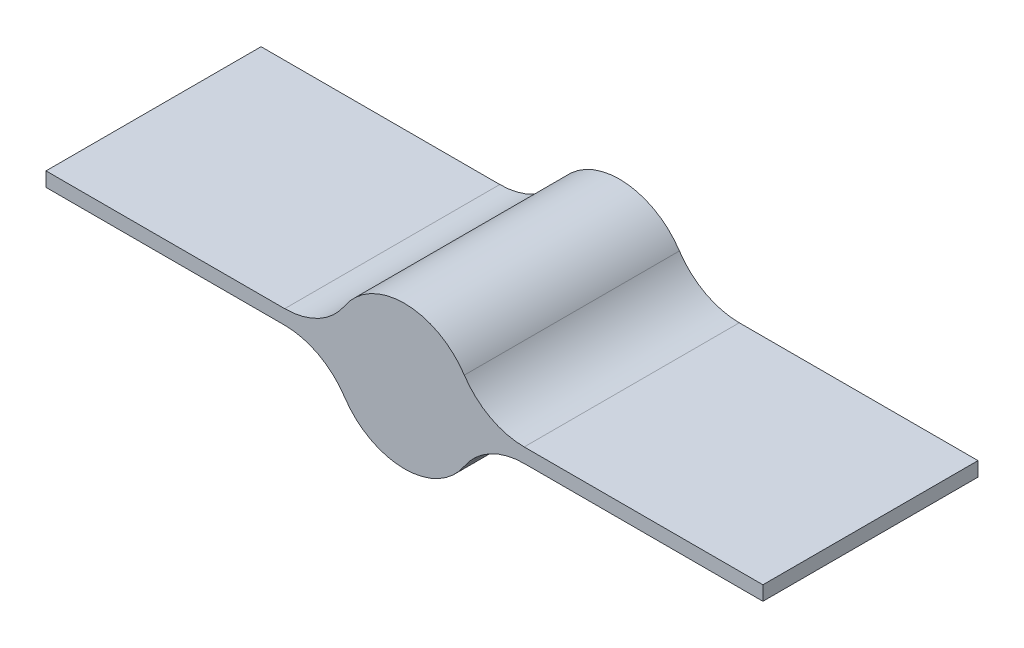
ISO-10303-21;
HEADER;
FILE_DESCRIPTION(('STEP AP214'),'2;1');
FILE_NAME('part.step','',(''),(''),'','','');
FILE_SCHEMA(('AUTOMOTIVE_DESIGN { 1 0 10303 214 1 1 1 1 }'));
ENDSEC;
DATA;
#1=APPLICATION_CONTEXT('core data for automotive mechanical design processes');
#2=APPLICATION_PROTOCOL_DEFINITION('international standard','automotive_design',2000,#1);
#3=PRODUCT_CONTEXT('',#1,'mechanical');
#4=PRODUCT('Part','Part','',(#3));
#5=PRODUCT_RELATED_PRODUCT_CATEGORY('part','',(#4));
#6=PRODUCT_DEFINITION_FORMATION('','',#4);
#7=PRODUCT_DEFINITION_CONTEXT('part definition',#1,'design');
#8=PRODUCT_DEFINITION('design','',#6,#7);
#9=PRODUCT_DEFINITION_SHAPE('','',#8);
#10=(LENGTH_UNIT() NAMED_UNIT(*) SI_UNIT(.MILLI.,.METRE.));
#11=(NAMED_UNIT(*) PLANE_ANGLE_UNIT() SI_UNIT($,.RADIAN.));
#12=(NAMED_UNIT(*) SI_UNIT($,.STERADIAN.) SOLID_ANGLE_UNIT());
#13=UNCERTAINTY_MEASURE_WITH_UNIT(LENGTH_MEASURE(1.E-05),#10,'distance_accuracy_value','');
#14=(GEOMETRIC_REPRESENTATION_CONTEXT(3) GLOBAL_UNCERTAINTY_ASSIGNED_CONTEXT((#13)) GLOBAL_UNIT_ASSIGNED_CONTEXT((#10,
#11,#12)) REPRESENTATION_CONTEXT('',''));
#15=CARTESIAN_POINT('',(0.,0.,0.));
#16=DIRECTION('',(0.,0.,1.));
#17=DIRECTION('',(1.,0.,0.));
#18=AXIS2_PLACEMENT_3D('',#15,#16,#17);
#19=CARTESIAN_POINT('',(0.,0.,30.));
#20=DIRECTION('',(0.,1.,0.));
#21=DIRECTION('',(0.,0.,1.));
#22=AXIS2_PLACEMENT_3D('',#19,#20,#21);
#23=PLANE('',#22);
#24=DIRECTION('',(1.,0.,0.));
#25=VECTOR('',#24,1.);
#26=CARTESIAN_POINT('',(0.,0.,0.));
#27=LINE('',#26,#25);
#28=CARTESIAN_POINT('',(0.,0.,0.));
#29=VERTEX_POINT('',#28);
#30=CARTESIAN_POINT('',(33.2967069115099,0.,0.));
#31=VERTEX_POINT('',#30);
#32=EDGE_CURVE('E120',#29,#31,#27,.T.);
#33=ORIENTED_EDGE('',*,*,#32,.T.);
#34=DIRECTION('',(0.,0.,1.));
#35=VECTOR('',#34,1.);
#36=CARTESIAN_POINT('',(33.2967069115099,0.,30.));
#37=LINE('',#36,#35);
#38=CARTESIAN_POINT('',(33.2967069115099,0.,30.));
#39=VERTEX_POINT('',#38);
#40=EDGE_CURVE('E182',#31,#39,#37,.T.);
#41=ORIENTED_EDGE('',*,*,#40,.T.);
#42=DIRECTION('',(1.,0.,0.));
#43=VECTOR('',#42,1.);
#44=CARTESIAN_POINT('',(0.,0.,30.));
#45=LINE('',#44,#43);
#46=CARTESIAN_POINT('',(0.,0.,30.));
#47=VERTEX_POINT('',#46);
#48=EDGE_CURVE('E138',#47,#39,#45,.T.);
#49=ORIENTED_EDGE('',*,*,#48,.F.);
#50=DIRECTION('',(0.,0.,-1.));
#51=VECTOR('',#50,1.);
#52=CARTESIAN_POINT('',(0.,0.,30.));
#53=LINE('',#52,#51);
#54=EDGE_CURVE('E136',#47,#29,#53,.T.);
#55=ORIENTED_EDGE('',*,*,#54,.T.);
#56=EDGE_LOOP('',(#33,#41,#49,#55));
#57=FACE_BOUND('',#56,.T.);
#58=ADVANCED_FACE('F32',(#57),#23,.F.);
#59=CARTESIAN_POINT('',(0.,2.,30.));
#60=DIRECTION('',(0.,-1.,0.));
#61=DIRECTION('',(0.,0.,-1.));
#62=AXIS2_PLACEMENT_3D('',#59,#60,#61);
#63=PLANE('',#62);
#64=DIRECTION('',(-1.,0.,0.));
#65=VECTOR('',#64,1.);
#66=CARTESIAN_POINT('',(0.,2.,0.));
#67=LINE('',#66,#65);
#68=CARTESIAN_POINT('',(100.,2.,0.));
#69=VERTEX_POINT('',#68);
#70=CARTESIAN_POINT('',(66.7032930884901,2.,0.));
#71=VERTEX_POINT('',#70);
#72=EDGE_CURVE('E157',#69,#71,#67,.T.);
#73=ORIENTED_EDGE('',*,*,#72,.T.);
#74=DIRECTION('',(0.,0.,1.));
#75=VECTOR('',#74,1.);
#76=CARTESIAN_POINT('',(66.7032930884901,2.,30.));
#77=LINE('',#76,#75);
#78=CARTESIAN_POINT('',(66.7032930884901,2.,30.));
#79=VERTEX_POINT('',#78);
#80=EDGE_CURVE('E188',#71,#79,#77,.T.);
#81=ORIENTED_EDGE('',*,*,#80,.T.);
#82=DIRECTION('',(-1.,0.,0.));
#83=VECTOR('',#82,1.);
#84=CARTESIAN_POINT('',(0.,2.,30.));
#85=LINE('',#84,#83);
#86=CARTESIAN_POINT('',(100.,2.,30.));
#87=VERTEX_POINT('',#86);
#88=EDGE_CURVE('E167',#87,#79,#85,.T.);
#89=ORIENTED_EDGE('',*,*,#88,.F.);
#90=DIRECTION('',(0.,0.,-1.));
#91=VECTOR('',#90,1.);
#92=CARTESIAN_POINT('',(100.,2.,30.));
#93=LINE('',#92,#91);
#94=EDGE_CURVE('E171',#87,#69,#93,.T.);
#95=ORIENTED_EDGE('',*,*,#94,.T.);
#96=EDGE_LOOP('',(#73,#81,#89,#95));
#97=FACE_BOUND('',#96,.T.);
#98=ADVANCED_FACE('F221',(#97),#63,.F.);
#99=CARTESIAN_POINT('',(0.,0.,30.));
#100=DIRECTION('',(1.,0.,0.));
#101=DIRECTION('',(0.,0.,-1.));
#102=AXIS2_PLACEMENT_3D('',#99,#100,#101);
#103=PLANE('',#102);
#104=DIRECTION('',(0.,-1.,0.));
#105=VECTOR('',#104,1.);
#106=CARTESIAN_POINT('',(0.,0.,0.));
#107=LINE('',#106,#105);
#108=CARTESIAN_POINT('',(0.,2.,0.));
#109=VERTEX_POINT('',#108);
#110=EDGE_CURVE('E125',#109,#29,#107,.T.);
#111=ORIENTED_EDGE('',*,*,#110,.T.);
#112=ORIENTED_EDGE('',*,*,#54,.F.);
#113=DIRECTION('',(0.,-1.,0.));
#114=VECTOR('',#113,1.);
#115=CARTESIAN_POINT('',(0.,0.,30.));
#116=LINE('',#115,#114);
#117=CARTESIAN_POINT('',(0.,2.,30.));
#118=VERTEX_POINT('',#117);
#119=EDGE_CURVE('E160',#118,#47,#116,.T.);
#120=ORIENTED_EDGE('',*,*,#119,.F.);
#121=DIRECTION('',(0.,0.,-1.));
#122=VECTOR('',#121,1.);
#123=CARTESIAN_POINT('',(0.,2.,30.));
#124=LINE('',#123,#122);
#125=EDGE_CURVE('E147',#118,#109,#124,.T.);
#126=ORIENTED_EDGE('',*,*,#125,.T.);
#127=EDGE_LOOP('',(#111,#112,#120,#126));
#128=FACE_BOUND('',#127,.T.);
#129=ADVANCED_FACE('F34',(#128),#103,.F.);
#130=CARTESIAN_POINT('',(66.7032930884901,0.,30.));
#131=VERTEX_POINT('',#130);
#132=CARTESIAN_POINT('',(100.,0.,30.));
#133=VERTEX_POINT('',#132);
#134=EDGE_CURVE('E162',#131,#133,#45,.T.);
#135=ORIENTED_EDGE('',*,*,#134,.F.);
#136=DIRECTION('',(0.,0.,1.));
#137=VECTOR('',#136,1.);
#138=CARTESIAN_POINT('',(66.7032930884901,0.,30.));
#139=LINE('',#138,#137);
#140=CARTESIAN_POINT('',(66.7032930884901,0.,0.));
#141=VERTEX_POINT('',#140);
#142=EDGE_CURVE('E191',#131,#141,#139,.F.);
#143=ORIENTED_EDGE('',*,*,#142,.T.);
#144=CARTESIAN_POINT('',(100.,0.,0.));
#145=VERTEX_POINT('',#144);
#146=EDGE_CURVE('E133',#141,#145,#27,.T.);
#147=ORIENTED_EDGE('',*,*,#146,.T.);
#148=DIRECTION('',(0.,0.,-1.));
#149=VECTOR('',#148,1.);
#150=CARTESIAN_POINT('',(100.,0.,30.));
#151=LINE('',#150,#149);
#152=EDGE_CURVE('E143',#133,#145,#151,.T.);
#153=ORIENTED_EDGE('',*,*,#152,.F.);
#154=EDGE_LOOP('',(#135,#143,#147,#153));
#155=FACE_BOUND('',#154,.T.);
#156=ADVANCED_FACE('F211',(#155),#23,.F.);
#157=CARTESIAN_POINT('',(100.,0.,30.));
#158=DIRECTION('',(-1.,0.,0.));
#159=DIRECTION('',(0.,0.,1.));
#160=AXIS2_PLACEMENT_3D('',#157,#158,#159);
#161=PLANE('',#160);
#162=DIRECTION('',(0.,1.,0.));
#163=VECTOR('',#162,1.);
#164=CARTESIAN_POINT('',(100.,0.,0.));
#165=LINE('',#164,#163);
#166=EDGE_CURVE('E132',#145,#69,#165,.T.);
#167=ORIENTED_EDGE('',*,*,#166,.T.);
#168=ORIENTED_EDGE('',*,*,#94,.F.);
#169=DIRECTION('',(0.,1.,0.));
#170=VECTOR('',#169,1.);
#171=CARTESIAN_POINT('',(100.,0.,30.));
#172=LINE('',#171,#170);
#173=EDGE_CURVE('E164',#133,#87,#172,.T.);
#174=ORIENTED_EDGE('',*,*,#173,.F.);
#175=ORIENTED_EDGE('',*,*,#152,.T.);
#176=EDGE_LOOP('',(#167,#168,#174,#175));
#177=FACE_BOUND('',#176,.T.);
#178=ADVANCED_FACE('F218',(#177),#161,.F.);
#179=CARTESIAN_POINT('',(33.2967069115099,2.,30.));
#180=VERTEX_POINT('',#179);
#181=EDGE_CURVE('E166',#180,#118,#85,.T.);
#182=ORIENTED_EDGE('',*,*,#181,.F.);
#183=DIRECTION('',(0.,0.,1.));
#184=VECTOR('',#183,1.);
#185=CARTESIAN_POINT('',(33.2967069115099,2.,30.));
#186=LINE('',#185,#184);
#187=CARTESIAN_POINT('',(33.2967069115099,2.,0.));
#188=VERTEX_POINT('',#187);
#189=EDGE_CURVE('E142',#180,#188,#186,.F.);
#190=ORIENTED_EDGE('',*,*,#189,.T.);
#191=EDGE_CURVE('E156',#188,#109,#67,.T.);
#192=ORIENTED_EDGE('',*,*,#191,.T.);
#193=ORIENTED_EDGE('',*,*,#125,.F.);
#194=EDGE_LOOP('',(#182,#190,#192,#193));
#195=FACE_BOUND('',#194,.T.);
#196=ADVANCED_FACE('F242',(#195),#63,.F.);
#197=CARTESIAN_POINT('',(0.,2.,30.));
#198=DIRECTION('',(0.,0.,-1.));
#199=DIRECTION('',(-1.,0.,0.));
#200=AXIS2_PLACEMENT_3D('',#197,#198,#199);
#201=PLANE('',#200);
#202=ORIENTED_EDGE('',*,*,#48,.T.);
#203=CARTESIAN_POINT('',(33.2967069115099,-10.,30.));
#204=DIRECTION('',(0.,0.,-1.));
#205=DIRECTION('',(-1.,0.,0.));
#206=AXIS2_PLACEMENT_3D('',#203,#204,#205);
#207=CIRCLE('',#206,10.);
#208=CARTESIAN_POINT('',(41.648353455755,-4.5,30.));
#209=VERTEX_POINT('',#208);
#210=EDGE_CURVE('E197',#39,#209,#207,.T.);
#211=ORIENTED_EDGE('',*,*,#210,.T.);
#212=CARTESIAN_POINT('',(50.,1.,30.));
#213=DIRECTION('',(0.,0.,1.));
#214=DIRECTION('',(1.,0.,0.));
#215=AXIS2_PLACEMENT_3D('',#212,#213,#214);
#216=CIRCLE('',#215,10.);
#217=CARTESIAN_POINT('',(58.351646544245,-4.5,30.));
#218=VERTEX_POINT('',#217);
#219=EDGE_CURVE('E236',#209,#218,#216,.T.);
#220=ORIENTED_EDGE('',*,*,#219,.T.);
#221=CARTESIAN_POINT('',(66.7032930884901,-10.,30.));
#222=DIRECTION('',(0.,0.,-1.));
#223=DIRECTION('',(-1.,0.,0.));
#224=AXIS2_PLACEMENT_3D('',#221,#222,#223);
#225=CIRCLE('',#224,10.);
#226=EDGE_CURVE('E11',#218,#131,#225,.T.);
#227=ORIENTED_EDGE('',*,*,#226,.T.);
#228=ORIENTED_EDGE('',*,*,#134,.T.);
#229=ORIENTED_EDGE('',*,*,#173,.T.);
#230=ORIENTED_EDGE('',*,*,#88,.T.);
#231=CARTESIAN_POINT('',(66.7032930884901,12.,30.));
#232=DIRECTION('',(0.,0.,-1.));
#233=DIRECTION('',(-1.,0.,0.));
#234=AXIS2_PLACEMENT_3D('',#231,#232,#233);
#235=CIRCLE('',#234,10.);
#236=CARTESIAN_POINT('',(58.351646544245,6.5,30.));
#237=VERTEX_POINT('',#236);
#238=EDGE_CURVE('E200',#79,#237,#235,.T.);
#239=ORIENTED_EDGE('',*,*,#238,.T.);
#240=CARTESIAN_POINT('',(41.648353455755,6.5,30.));
#241=VERTEX_POINT('',#240);
#242=EDGE_CURVE('E229',#237,#241,#216,.T.);
#243=ORIENTED_EDGE('',*,*,#242,.T.);
#244=CARTESIAN_POINT('',(33.2967069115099,12.,30.));
#245=DIRECTION('',(0.,0.,-1.));
#246=DIRECTION('',(-1.,0.,0.));
#247=AXIS2_PLACEMENT_3D('',#244,#245,#246);
#248=CIRCLE('',#247,10.);
#249=EDGE_CURVE('E195',#241,#180,#248,.T.);
#250=ORIENTED_EDGE('',*,*,#249,.T.);
#251=ORIENTED_EDGE('',*,*,#181,.T.);
#252=ORIENTED_EDGE('',*,*,#119,.T.);
#253=EDGE_LOOP('',(#202,#211,#220,#227,#228,#229,#230,#239,#243,#250,#251,#252));
#254=FACE_BOUND('',#253,.T.);
#255=ADVANCED_FACE('F214',(#254),#201,.F.);
#256=CARTESIAN_POINT('',(0.,2.,0.));
#257=DIRECTION('',(0.,0.,-1.));
#258=DIRECTION('',(-1.,0.,0.));
#259=AXIS2_PLACEMENT_3D('',#256,#257,#258);
#260=PLANE('',#259);
#261=ORIENTED_EDGE('',*,*,#191,.F.);
#262=CARTESIAN_POINT('',(33.2967069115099,12.,0.));
#263=DIRECTION('',(0.,0.,-1.));
#264=DIRECTION('',(-1.,0.,0.));
#265=AXIS2_PLACEMENT_3D('',#262,#263,#264);
#266=CIRCLE('',#265,10.);
#267=CARTESIAN_POINT('',(41.648353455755,6.5,0.));
#268=VERTEX_POINT('',#267);
#269=EDGE_CURVE('E193',#188,#268,#266,.F.);
#270=ORIENTED_EDGE('',*,*,#269,.T.);
#271=CARTESIAN_POINT('',(50.,1.,0.));
#272=DIRECTION('',(0.,0.,-1.));
#273=DIRECTION('',(-1.,0.,0.));
#274=AXIS2_PLACEMENT_3D('',#271,#272,#273);
#275=CIRCLE('',#274,10.);
#276=CARTESIAN_POINT('',(58.351646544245,6.5,0.));
#277=VERTEX_POINT('',#276);
#278=EDGE_CURVE('E151',#277,#268,#275,.F.);
#279=ORIENTED_EDGE('',*,*,#278,.F.);
#280=CARTESIAN_POINT('',(66.7032930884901,12.,0.));
#281=DIRECTION('',(0.,0.,-1.));
#282=DIRECTION('',(-1.,0.,0.));
#283=AXIS2_PLACEMENT_3D('',#280,#281,#282);
#284=CIRCLE('',#283,10.);
#285=EDGE_CURVE('E202',#277,#71,#284,.F.);
#286=ORIENTED_EDGE('',*,*,#285,.T.);
#287=ORIENTED_EDGE('',*,*,#72,.F.);
#288=ORIENTED_EDGE('',*,*,#166,.F.);
#289=ORIENTED_EDGE('',*,*,#146,.F.);
#290=CARTESIAN_POINT('',(66.7032930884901,-10.,0.));
#291=DIRECTION('',(0.,0.,-1.));
#292=DIRECTION('',(-1.,0.,0.));
#293=AXIS2_PLACEMENT_3D('',#290,#291,#292);
#294=CIRCLE('',#293,10.);
#295=CARTESIAN_POINT('',(58.351646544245,-4.5,0.));
#296=VERTEX_POINT('',#295);
#297=EDGE_CURVE('E40',#141,#296,#294,.F.);
#298=ORIENTED_EDGE('',*,*,#297,.T.);
#299=CARTESIAN_POINT('',(41.648353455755,-4.5,0.));
#300=VERTEX_POINT('',#299);
#301=EDGE_CURVE('E148',#300,#296,#275,.F.);
#302=ORIENTED_EDGE('',*,*,#301,.F.);
#303=CARTESIAN_POINT('',(33.2967069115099,-10.,0.));
#304=DIRECTION('',(0.,0.,-1.));
#305=DIRECTION('',(-1.,0.,0.));
#306=AXIS2_PLACEMENT_3D('',#303,#304,#305);
#307=CIRCLE('',#306,10.);
#308=EDGE_CURVE('E128',#300,#31,#307,.F.);
#309=ORIENTED_EDGE('',*,*,#308,.T.);
#310=ORIENTED_EDGE('',*,*,#32,.F.);
#311=ORIENTED_EDGE('',*,*,#110,.F.);
#312=EDGE_LOOP('',(#261,#270,#279,#286,#287,#288,#289,#298,#302,#309,#310,#311));
#313=FACE_BOUND('',#312,.T.);
#314=ADVANCED_FACE('F123',(#313),#260,.T.);
#315=CARTESIAN_POINT('',(50.,1.,-28.2842712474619));
#316=DIRECTION('',(0.,0.,1.));
#317=DIRECTION('',(1.,0.,0.));
#318=AXIS2_PLACEMENT_3D('',#315,#316,#317);
#319=CYLINDRICAL_SURFACE('',#318,10.);
#320=ORIENTED_EDGE('',*,*,#278,.T.);
#321=DIRECTION('',(0.,0.,1.));
#322=VECTOR('',#321,1.);
#323=CARTESIAN_POINT('',(41.648353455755,6.5,-28.2842712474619));
#324=LINE('',#323,#322);
#325=EDGE_CURVE('E180',#268,#241,#324,.T.);
#326=ORIENTED_EDGE('',*,*,#325,.T.);
#327=ORIENTED_EDGE('',*,*,#242,.F.);
#328=DIRECTION('',(0.,0.,1.));
#329=VECTOR('',#328,1.);
#330=CARTESIAN_POINT('',(58.351646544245,6.5,-28.2842712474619));
#331=LINE('',#330,#329);
#332=EDGE_CURVE('E178',#237,#277,#331,.F.);
#333=ORIENTED_EDGE('',*,*,#332,.T.);
#334=EDGE_LOOP('',(#320,#326,#327,#333));
#335=FACE_BOUND('',#334,.T.);
#336=ADVANCED_FACE('F233',(#335),#319,.T.);
#337=ORIENTED_EDGE('',*,*,#219,.F.);
#338=DIRECTION('',(0.,0.,1.));
#339=VECTOR('',#338,1.);
#340=CARTESIAN_POINT('',(41.648353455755,-4.5,-28.2842712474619));
#341=LINE('',#340,#339);
#342=EDGE_CURVE('E186',#209,#300,#341,.F.);
#343=ORIENTED_EDGE('',*,*,#342,.T.);
#344=ORIENTED_EDGE('',*,*,#301,.T.);
#345=DIRECTION('',(0.,0.,1.));
#346=VECTOR('',#345,1.);
#347=CARTESIAN_POINT('',(58.351646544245,-4.5,-28.2842712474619));
#348=LINE('',#347,#346);
#349=EDGE_CURVE('E184',#296,#218,#348,.T.);
#350=ORIENTED_EDGE('',*,*,#349,.T.);
#351=EDGE_LOOP('',(#337,#343,#344,#350));
#352=FACE_BOUND('',#351,.T.);
#353=ADVANCED_FACE('F207',(#352),#319,.T.);
#354=CARTESIAN_POINT('',(33.2967069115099,12.,-28.2842712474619));
#355=DIRECTION('',(0.,0.,1.));
#356=DIRECTION('',(1.,0.,0.));
#357=AXIS2_PLACEMENT_3D('',#354,#355,#356);
#358=CYLINDRICAL_SURFACE('',#357,10.);
#359=ORIENTED_EDGE('',*,*,#249,.F.);
#360=ORIENTED_EDGE('',*,*,#325,.F.);
#361=ORIENTED_EDGE('',*,*,#269,.F.);
#362=ORIENTED_EDGE('',*,*,#189,.F.);
#363=EDGE_LOOP('',(#359,#360,#361,#362));
#364=FACE_BOUND('',#363,.T.);
#365=ADVANCED_FACE('F244',(#364),#358,.F.);
#366=CARTESIAN_POINT('',(33.2967069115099,-10.,-28.2842712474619));
#367=DIRECTION('',(0.,0.,1.));
#368=DIRECTION('',(1.,0.,0.));
#369=AXIS2_PLACEMENT_3D('',#366,#367,#368);
#370=CYLINDRICAL_SURFACE('',#369,10.);
#371=ORIENTED_EDGE('',*,*,#308,.F.);
#372=ORIENTED_EDGE('',*,*,#342,.F.);
#373=ORIENTED_EDGE('',*,*,#210,.F.);
#374=ORIENTED_EDGE('',*,*,#40,.F.);
#375=EDGE_LOOP('',(#371,#372,#373,#374));
#376=FACE_BOUND('',#375,.T.);
#377=ADVANCED_FACE('F238',(#376),#370,.F.);
#378=CARTESIAN_POINT('',(66.7032930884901,12.,-28.2842712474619));
#379=DIRECTION('',(0.,0.,1.));
#380=DIRECTION('',(1.,0.,0.));
#381=AXIS2_PLACEMENT_3D('',#378,#379,#380);
#382=CYLINDRICAL_SURFACE('',#381,10.);
#383=ORIENTED_EDGE('',*,*,#285,.F.);
#384=ORIENTED_EDGE('',*,*,#332,.F.);
#385=ORIENTED_EDGE('',*,*,#238,.F.);
#386=ORIENTED_EDGE('',*,*,#80,.F.);
#387=EDGE_LOOP('',(#383,#384,#385,#386));
#388=FACE_BOUND('',#387,.T.);
#389=ADVANCED_FACE('F225',(#388),#382,.F.);
#390=CARTESIAN_POINT('',(66.7032930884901,-10.,-28.2842712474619));
#391=DIRECTION('',(0.,0.,1.));
#392=DIRECTION('',(1.,0.,0.));
#393=AXIS2_PLACEMENT_3D('',#390,#391,#392);
#394=CYLINDRICAL_SURFACE('',#393,10.);
#395=ORIENTED_EDGE('',*,*,#226,.F.);
#396=ORIENTED_EDGE('',*,*,#349,.F.);
#397=ORIENTED_EDGE('',*,*,#297,.F.);
#398=ORIENTED_EDGE('',*,*,#142,.F.);
#399=EDGE_LOOP('',(#395,#396,#397,#398));
#400=FACE_BOUND('',#399,.T.);
#401=ADVANCED_FACE('F209',(#400),#394,.F.);
#402=CLOSED_SHELL('',(#58,#98,#129,#156,#178,#196,#255,#314,#336,#353,#365,#377,#389,#401));
#403=MANIFOLD_SOLID_BREP('B2',#402);
#404=ADVANCED_BREP_SHAPE_REPRESENTATION('',(#18,#403),#14);
#405=SHAPE_DEFINITION_REPRESENTATION(#9,#404);
ENDSEC;
END-ISO-10303-21;
